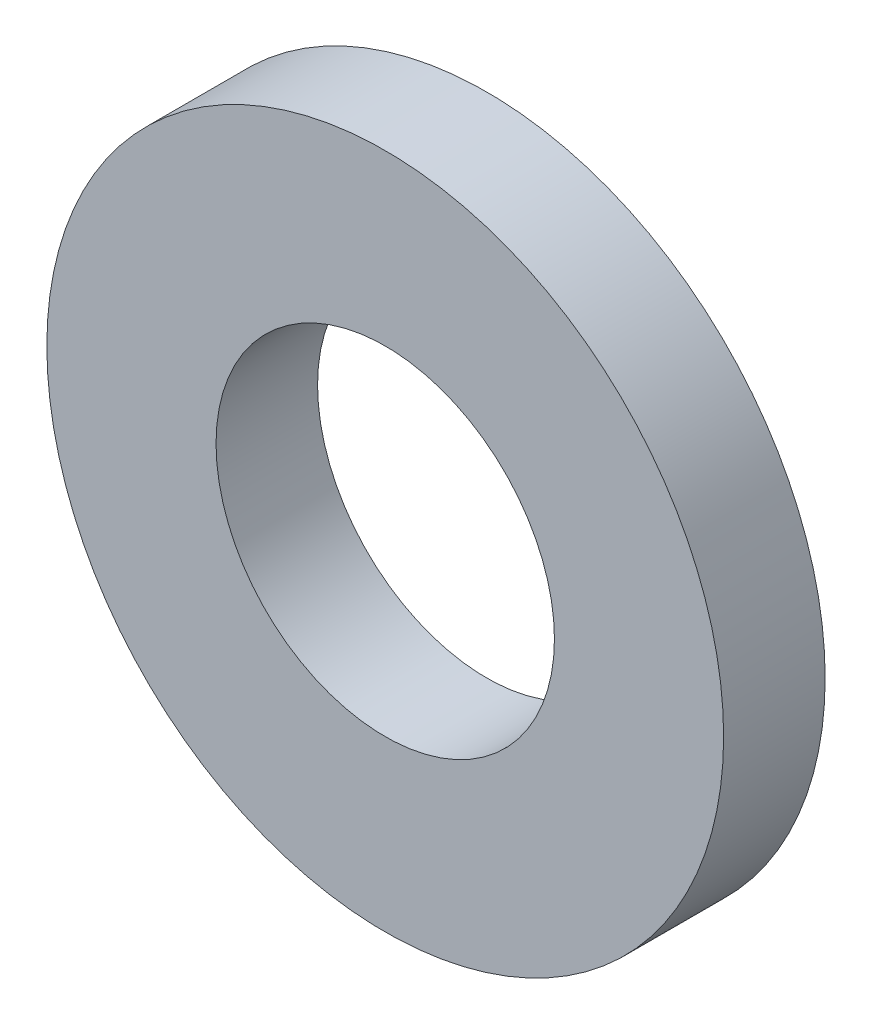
from build123d import *

# Parameters (mm, degrees)
ESQUISSE1_R        = 5
ESQUISSE1_R_2      = 2.5
BOSS_EXTRU_1_DEPTH = 1.5


with BuildPart() as part:
    # Esquisse1 → Boss.-Extru.1 (new body)
    with BuildSketch(Plane.XY):
        Circle(ESQUISSE1_R)
        Circle(ESQUISSE1_R_2, mode=Mode.SUBTRACT)
    extrude(amount=BOSS_EXTRU_1_DEPTH)


solid = part.part
